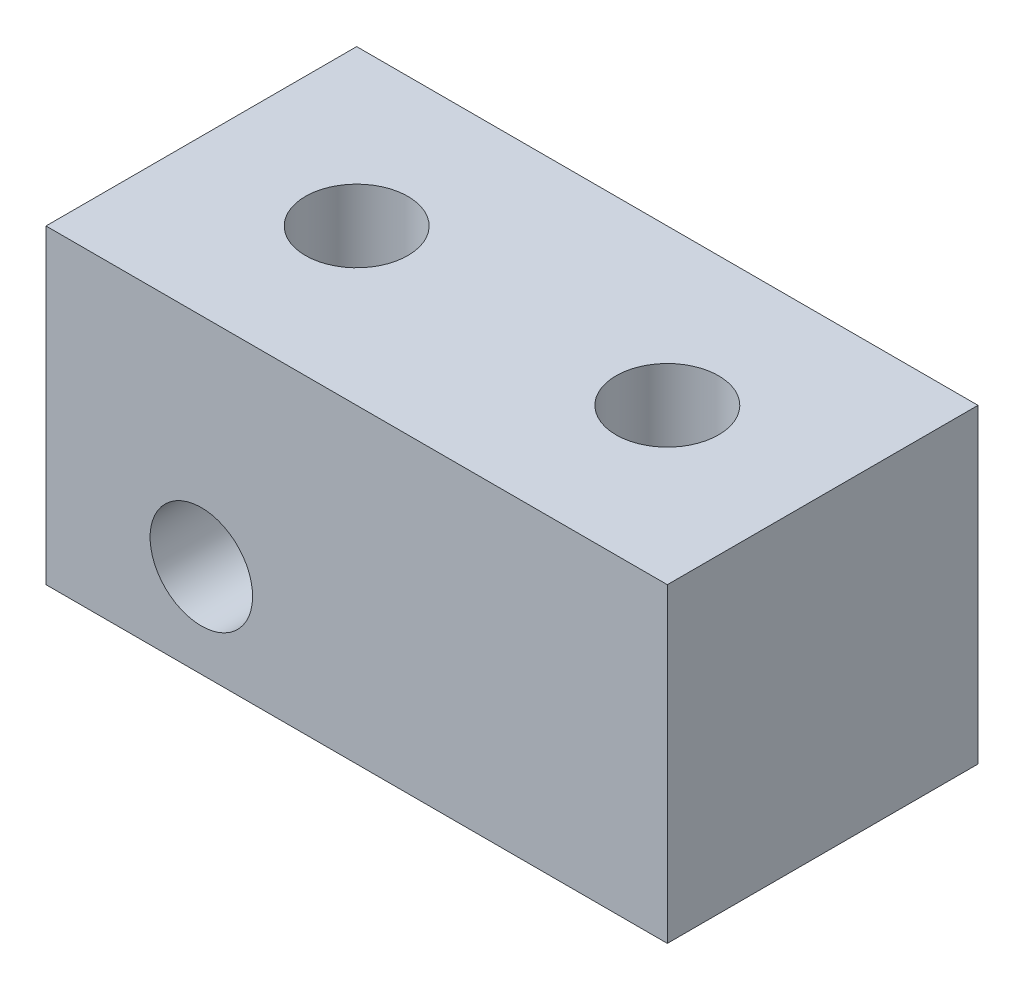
ISO-10303-21;
HEADER;
FILE_DESCRIPTION(('STEP AP214'),'2;1');
FILE_NAME('part.step','',(''),(''),'','','');
FILE_SCHEMA(('AUTOMOTIVE_DESIGN { 1 0 10303 214 1 1 1 1 }'));
ENDSEC;
DATA;
#1=APPLICATION_CONTEXT('core data for automotive mechanical design processes');
#2=APPLICATION_PROTOCOL_DEFINITION('international standard','automotive_design',2000,#1);
#3=PRODUCT_CONTEXT('',#1,'mechanical');
#4=PRODUCT('Part','Part','',(#3));
#5=PRODUCT_RELATED_PRODUCT_CATEGORY('part','',(#4));
#6=PRODUCT_DEFINITION_FORMATION('','',#4);
#7=PRODUCT_DEFINITION_CONTEXT('part definition',#1,'design');
#8=PRODUCT_DEFINITION('design','',#6,#7);
#9=PRODUCT_DEFINITION_SHAPE('','',#8);
#10=(LENGTH_UNIT() NAMED_UNIT(*) SI_UNIT(.MILLI.,.METRE.));
#11=(NAMED_UNIT(*) PLANE_ANGLE_UNIT() SI_UNIT($,.RADIAN.));
#12=(NAMED_UNIT(*) SI_UNIT($,.STERADIAN.) SOLID_ANGLE_UNIT());
#13=UNCERTAINTY_MEASURE_WITH_UNIT(LENGTH_MEASURE(1.E-05),#10,'distance_accuracy_value','');
#14=(GEOMETRIC_REPRESENTATION_CONTEXT(3) GLOBAL_UNCERTAINTY_ASSIGNED_CONTEXT((#13)) GLOBAL_UNIT_ASSIGNED_CONTEXT((#10,
#11,#12)) REPRESENTATION_CONTEXT('',''));
#15=CARTESIAN_POINT('',(0.,0.,0.));
#16=DIRECTION('',(0.,0.,1.));
#17=DIRECTION('',(1.,0.,0.));
#18=AXIS2_PLACEMENT_3D('',#15,#16,#17);
#19=CARTESIAN_POINT('',(5.,10.,5.));
#20=DIRECTION('',(0.,1.,0.));
#21=DIRECTION('',(0.,0.,1.));
#22=AXIS2_PLACEMENT_3D('',#19,#20,#21);
#23=CYLINDRICAL_SURFACE('',#22,1.64999999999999);
#24=CARTESIAN_POINT('',(5.,10.,5.));
#25=DIRECTION('',(0.,1.,0.));
#26=DIRECTION('',(0.,0.,1.));
#27=AXIS2_PLACEMENT_3D('',#24,#25,#26);
#28=CIRCLE('',#27,1.64999999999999);
#29=CARTESIAN_POINT('',(5.,10.,6.64999999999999));
#30=VERTEX_POINT('',#29);
#31=EDGE_CURVE('E135',#30,#30,#28,.T.);
#32=ORIENTED_EDGE('',*,*,#31,.T.);
#33=EDGE_LOOP('',(#32));
#34=FACE_BOUND('',#33,.T.);
#35=CARTESIAN_POINT('',(5.,3.,5.));
#36=DIRECTION('',(0.,0.707106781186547,-0.707106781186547));
#37=DIRECTION('',(0.,0.707106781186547,0.707106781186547));
#38=AXIS2_PLACEMENT_3D('',#35,#36,#37);
#39=ELLIPSE('',#38,2.3334523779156,1.65);
#40=CARTESIAN_POINT('',(6.65,3.,5.));
#41=VERTEX_POINT('',#40);
#42=CARTESIAN_POINT('',(3.35,3.,5.));
#43=VERTEX_POINT('',#42);
#44=EDGE_CURVE('E48',#41,#43,#39,.F.);
#45=ORIENTED_EDGE('',*,*,#44,.T.);
#46=CARTESIAN_POINT('',(5.,3.,5.));
#47=DIRECTION('',(0.,0.707106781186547,0.707106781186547));
#48=DIRECTION('',(0.,0.707106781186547,-0.707106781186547));
#49=AXIS2_PLACEMENT_3D('',#46,#47,#48);
#50=ELLIPSE('',#49,2.3334523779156,1.65);
#51=EDGE_CURVE('E11',#43,#41,#50,.F.);
#52=ORIENTED_EDGE('',*,*,#51,.T.);
#53=EDGE_LOOP('',(#45,#52));
#54=FACE_BOUND('',#53,.T.);
#55=ADVANCED_FACE('F35',(#34,#54),#23,.F.);
#56=CARTESIAN_POINT('',(0.,0.,10.));
#57=DIRECTION('',(1.,0.,0.));
#58=DIRECTION('',(0.,0.,-1.));
#59=AXIS2_PLACEMENT_3D('',#56,#57,#58);
#60=PLANE('',#59);
#61=DIRECTION('',(0.,-1.,0.));
#62=VECTOR('',#61,1.);
#63=CARTESIAN_POINT('',(0.,0.,0.));
#64=LINE('',#63,#62);
#65=CARTESIAN_POINT('',(0.,10.,0.));
#66=VERTEX_POINT('',#65);
#67=CARTESIAN_POINT('',(0.,0.,0.));
#68=VERTEX_POINT('',#67);
#69=EDGE_CURVE('E118',#66,#68,#64,.T.);
#70=ORIENTED_EDGE('',*,*,#69,.T.);
#71=DIRECTION('',(0.,0.,-1.));
#72=VECTOR('',#71,1.);
#73=CARTESIAN_POINT('',(0.,0.,10.));
#74=LINE('',#73,#72);
#75=CARTESIAN_POINT('',(0.,0.,10.));
#76=VERTEX_POINT('',#75);
#77=EDGE_CURVE('E99',#76,#68,#74,.T.);
#78=ORIENTED_EDGE('',*,*,#77,.F.);
#79=DIRECTION('',(0.,-1.,0.));
#80=VECTOR('',#79,1.);
#81=CARTESIAN_POINT('',(0.,0.,10.));
#82=LINE('',#81,#80);
#83=CARTESIAN_POINT('',(0.,10.,10.));
#84=VERTEX_POINT('',#83);
#85=EDGE_CURVE('E113',#84,#76,#82,.T.);
#86=ORIENTED_EDGE('',*,*,#85,.F.);
#87=DIRECTION('',(0.,0.,-1.));
#88=VECTOR('',#87,1.);
#89=CARTESIAN_POINT('',(0.,10.,10.));
#90=LINE('',#89,#88);
#91=EDGE_CURVE('E110',#84,#66,#90,.T.);
#92=ORIENTED_EDGE('',*,*,#91,.T.);
#93=EDGE_LOOP('',(#70,#78,#86,#92));
#94=FACE_BOUND('',#93,.T.);
#95=ADVANCED_FACE('F37',(#94),#60,.F.);
#96=CARTESIAN_POINT('',(0.,0.,10.));
#97=DIRECTION('',(0.,1.,0.));
#98=DIRECTION('',(0.,0.,1.));
#99=AXIS2_PLACEMENT_3D('',#96,#97,#98);
#100=PLANE('',#99);
#101=CARTESIAN_POINT('',(5.,0.,5.));
#102=DIRECTION('',(0.,1.,0.));
#103=DIRECTION('',(0.,0.,1.));
#104=AXIS2_PLACEMENT_3D('',#101,#102,#103);
#105=CIRCLE('',#104,1.65);
#106=CARTESIAN_POINT('',(5.,0.,6.65));
#107=VERTEX_POINT('',#106);
#108=EDGE_CURVE('E132',#107,#107,#105,.T.);
#109=ORIENTED_EDGE('',*,*,#108,.T.);
#110=EDGE_LOOP('',(#109));
#111=FACE_BOUND('',#110,.T.);
#112=CARTESIAN_POINT('',(15.,0.,5.));
#113=DIRECTION('',(0.,1.,0.));
#114=DIRECTION('',(0.,0.,1.));
#115=AXIS2_PLACEMENT_3D('',#112,#113,#114);
#116=CIRCLE('',#115,1.65);
#117=CARTESIAN_POINT('',(15.,0.,6.65));
#118=VERTEX_POINT('',#117);
#119=EDGE_CURVE('E121',#118,#118,#116,.T.);
#120=ORIENTED_EDGE('',*,*,#119,.T.);
#121=EDGE_LOOP('',(#120));
#122=FACE_BOUND('',#121,.T.);
#123=DIRECTION('',(1.,0.,0.));
#124=VECTOR('',#123,1.);
#125=CARTESIAN_POINT('',(0.,0.,0.));
#126=LINE('',#125,#124);
#127=CARTESIAN_POINT('',(20.,0.,0.));
#128=VERTEX_POINT('',#127);
#129=EDGE_CURVE('E116',#68,#128,#126,.T.);
#130=ORIENTED_EDGE('',*,*,#129,.T.);
#131=DIRECTION('',(0.,0.,-1.));
#132=VECTOR('',#131,1.);
#133=CARTESIAN_POINT('',(20.,0.,10.));
#134=LINE('',#133,#132);
#135=CARTESIAN_POINT('',(20.,0.,10.));
#136=VERTEX_POINT('',#135);
#137=EDGE_CURVE('E105',#136,#128,#134,.T.);
#138=ORIENTED_EDGE('',*,*,#137,.F.);
#139=DIRECTION('',(1.,0.,0.));
#140=VECTOR('',#139,1.);
#141=CARTESIAN_POINT('',(0.,0.,10.));
#142=LINE('',#141,#140);
#143=EDGE_CURVE('E86',#76,#136,#142,.T.);
#144=ORIENTED_EDGE('',*,*,#143,.F.);
#145=ORIENTED_EDGE('',*,*,#77,.T.);
#146=EDGE_LOOP('',(#130,#138,#144,#145));
#147=FACE_BOUND('',#146,.T.);
#148=ADVANCED_FACE('F155',(#111,#122,#147),#100,.F.);
#149=CARTESIAN_POINT('',(20.,0.,10.));
#150=DIRECTION('',(-1.,0.,0.));
#151=DIRECTION('',(0.,0.,1.));
#152=AXIS2_PLACEMENT_3D('',#149,#150,#151);
#153=PLANE('',#152);
#154=DIRECTION('',(0.,1.,0.));
#155=VECTOR('',#154,1.);
#156=CARTESIAN_POINT('',(20.,0.,0.));
#157=LINE('',#156,#155);
#158=CARTESIAN_POINT('',(20.,10.,0.));
#159=VERTEX_POINT('',#158);
#160=EDGE_CURVE('E114',#128,#159,#157,.T.);
#161=ORIENTED_EDGE('',*,*,#160,.T.);
#162=DIRECTION('',(0.,0.,-1.));
#163=VECTOR('',#162,1.);
#164=CARTESIAN_POINT('',(20.,10.,10.));
#165=LINE('',#164,#163);
#166=CARTESIAN_POINT('',(20.,10.,10.));
#167=VERTEX_POINT('',#166);
#168=EDGE_CURVE('E108',#167,#159,#165,.T.);
#169=ORIENTED_EDGE('',*,*,#168,.F.);
#170=DIRECTION('',(0.,1.,0.));
#171=VECTOR('',#170,1.);
#172=CARTESIAN_POINT('',(20.,0.,10.));
#173=LINE('',#172,#171);
#174=EDGE_CURVE('E123',#136,#167,#173,.T.);
#175=ORIENTED_EDGE('',*,*,#174,.F.);
#176=ORIENTED_EDGE('',*,*,#137,.T.);
#177=EDGE_LOOP('',(#161,#169,#175,#176));
#178=FACE_BOUND('',#177,.T.);
#179=ADVANCED_FACE('F160',(#178),#153,.F.);
#180=CARTESIAN_POINT('',(0.,10.,10.));
#181=DIRECTION('',(0.,-1.,0.));
#182=DIRECTION('',(0.,0.,-1.));
#183=AXIS2_PLACEMENT_3D('',#180,#181,#182);
#184=PLANE('',#183);
#185=ORIENTED_EDGE('',*,*,#31,.F.);
#186=EDGE_LOOP('',(#185));
#187=FACE_BOUND('',#186,.T.);
#188=CARTESIAN_POINT('',(15.,10.,5.));
#189=DIRECTION('',(0.,1.,0.));
#190=DIRECTION('',(0.,0.,1.));
#191=AXIS2_PLACEMENT_3D('',#188,#189,#190);
#192=CIRCLE('',#191,1.64999999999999);
#193=CARTESIAN_POINT('',(15.,10.,6.64999999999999));
#194=VERTEX_POINT('',#193);
#195=EDGE_CURVE('E129',#194,#194,#192,.T.);
#196=ORIENTED_EDGE('',*,*,#195,.F.);
#197=EDGE_LOOP('',(#196));
#198=FACE_BOUND('',#197,.T.);
#199=DIRECTION('',(-1.,0.,0.));
#200=VECTOR('',#199,1.);
#201=CARTESIAN_POINT('',(0.,10.,0.));
#202=LINE('',#201,#200);
#203=EDGE_CURVE('E78',#159,#66,#202,.T.);
#204=ORIENTED_EDGE('',*,*,#203,.T.);
#205=ORIENTED_EDGE('',*,*,#91,.F.);
#206=DIRECTION('',(-1.,0.,0.));
#207=VECTOR('',#206,1.);
#208=CARTESIAN_POINT('',(0.,10.,10.));
#209=LINE('',#208,#207);
#210=EDGE_CURVE('E57',#167,#84,#209,.T.);
#211=ORIENTED_EDGE('',*,*,#210,.F.);
#212=ORIENTED_EDGE('',*,*,#168,.T.);
#213=EDGE_LOOP('',(#204,#205,#211,#212));
#214=FACE_BOUND('',#213,.T.);
#215=ADVANCED_FACE('F149',(#187,#198,#214),#184,.F.);
#216=CARTESIAN_POINT('',(0.,0.,10.));
#217=DIRECTION('',(0.,0.,-1.));
#218=DIRECTION('',(-1.,0.,0.));
#219=AXIS2_PLACEMENT_3D('',#216,#217,#218);
#220=PLANE('',#219);
#221=CARTESIAN_POINT('',(5.,3.,10.));
#222=DIRECTION('',(0.,0.,1.));
#223=DIRECTION('',(1.,0.,0.));
#224=AXIS2_PLACEMENT_3D('',#221,#222,#223);
#225=CIRCLE('',#224,1.65);
#226=CARTESIAN_POINT('',(6.65,3.,10.));
#227=VERTEX_POINT('',#226);
#228=EDGE_CURVE('E141',#227,#227,#225,.T.);
#229=ORIENTED_EDGE('',*,*,#228,.F.);
#230=EDGE_LOOP('',(#229));
#231=FACE_BOUND('',#230,.T.);
#232=ORIENTED_EDGE('',*,*,#85,.T.);
#233=ORIENTED_EDGE('',*,*,#143,.T.);
#234=ORIENTED_EDGE('',*,*,#174,.T.);
#235=ORIENTED_EDGE('',*,*,#210,.T.);
#236=EDGE_LOOP('',(#232,#233,#234,#235));
#237=FACE_BOUND('',#236,.T.);
#238=ADVANCED_FACE('F146',(#231,#237),#220,.F.);
#239=CARTESIAN_POINT('',(0.,0.,0.));
#240=DIRECTION('',(0.,0.,-1.));
#241=DIRECTION('',(-1.,0.,0.));
#242=AXIS2_PLACEMENT_3D('',#239,#240,#241);
#243=PLANE('',#242);
#244=CARTESIAN_POINT('',(5.,3.,0.));
#245=DIRECTION('',(0.,0.,1.));
#246=DIRECTION('',(1.,0.,0.));
#247=AXIS2_PLACEMENT_3D('',#244,#245,#246);
#248=CIRCLE('',#247,1.65);
#249=CARTESIAN_POINT('',(6.65,3.,0.));
#250=VERTEX_POINT('',#249);
#251=EDGE_CURVE('E138',#250,#250,#248,.T.);
#252=ORIENTED_EDGE('',*,*,#251,.T.);
#253=EDGE_LOOP('',(#252));
#254=FACE_BOUND('',#253,.T.);
#255=ORIENTED_EDGE('',*,*,#69,.F.);
#256=ORIENTED_EDGE('',*,*,#203,.F.);
#257=ORIENTED_EDGE('',*,*,#160,.F.);
#258=ORIENTED_EDGE('',*,*,#129,.F.);
#259=EDGE_LOOP('',(#255,#256,#257,#258));
#260=FACE_BOUND('',#259,.T.);
#261=ADVANCED_FACE('F148',(#254,#260),#243,.T.);
#262=CARTESIAN_POINT('',(15.,10.,5.));
#263=DIRECTION('',(0.,1.,0.));
#264=DIRECTION('',(0.,0.,1.));
#265=AXIS2_PLACEMENT_3D('',#262,#263,#264);
#266=CYLINDRICAL_SURFACE('',#265,1.64999999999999);
#267=ORIENTED_EDGE('',*,*,#119,.F.);
#268=EDGE_LOOP('',(#267));
#269=FACE_BOUND('',#268,.T.);
#270=ORIENTED_EDGE('',*,*,#195,.T.);
#271=EDGE_LOOP('',(#270));
#272=FACE_BOUND('',#271,.T.);
#273=ADVANCED_FACE('F163',(#269,#272),#266,.F.);
#274=CARTESIAN_POINT('',(5.,3.,5.));
#275=DIRECTION('',(0.,0.707106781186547,-0.707106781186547));
#276=DIRECTION('',(0.,0.707106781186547,0.707106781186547));
#277=AXIS2_PLACEMENT_3D('',#274,#275,#276);
#278=ELLIPSE('',#277,2.3334523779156,1.65);
#279=EDGE_CURVE('E92',#41,#43,#278,.T.);
#280=ORIENTED_EDGE('',*,*,#279,.T.);
#281=CARTESIAN_POINT('',(5.,3.,5.));
#282=DIRECTION('',(0.,0.707106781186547,0.707106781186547));
#283=DIRECTION('',(0.,0.707106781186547,-0.707106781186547));
#284=AXIS2_PLACEMENT_3D('',#281,#282,#283);
#285=ELLIPSE('',#284,2.3334523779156,1.65);
#286=EDGE_CURVE('E43',#43,#41,#285,.T.);
#287=ORIENTED_EDGE('',*,*,#286,.T.);
#288=EDGE_LOOP('',(#280,#287));
#289=FACE_BOUND('',#288,.T.);
#290=ORIENTED_EDGE('',*,*,#108,.F.);
#291=EDGE_LOOP('',(#290));
#292=FACE_BOUND('',#291,.T.);
#293=ADVANCED_FACE('F101',(#289,#292),#23,.F.);
#294=CARTESIAN_POINT('',(5.,3.,10.));
#295=DIRECTION('',(0.,0.,1.));
#296=DIRECTION('',(1.,0.,0.));
#297=AXIS2_PLACEMENT_3D('',#294,#295,#296);
#298=CYLINDRICAL_SURFACE('',#297,1.65);
#299=ORIENTED_EDGE('',*,*,#228,.T.);
#300=EDGE_LOOP('',(#299));
#301=FACE_BOUND('',#300,.T.);
#302=ORIENTED_EDGE('',*,*,#44,.F.);
#303=ORIENTED_EDGE('',*,*,#286,.F.);
#304=EDGE_LOOP('',(#302,#303));
#305=FACE_BOUND('',#304,.T.);
#306=ADVANCED_FACE('F98',(#301,#305),#298,.F.);
#307=ORIENTED_EDGE('',*,*,#251,.F.);
#308=EDGE_LOOP('',(#307));
#309=FACE_BOUND('',#308,.T.);
#310=ORIENTED_EDGE('',*,*,#279,.F.);
#311=ORIENTED_EDGE('',*,*,#51,.F.);
#312=EDGE_LOOP('',(#310,#311));
#313=FACE_BOUND('',#312,.T.);
#314=ADVANCED_FACE('F93',(#309,#313),#298,.F.);
#315=CLOSED_SHELL('',(#55,#95,#148,#179,#215,#238,#261,#273,#293,#306,#314));
#316=MANIFOLD_SOLID_BREP('B2',#315);
#317=ADVANCED_BREP_SHAPE_REPRESENTATION('',(#18,#316),#14);
#318=SHAPE_DEFINITION_REPRESENTATION(#9,#317);
ENDSEC;
END-ISO-10303-21;
